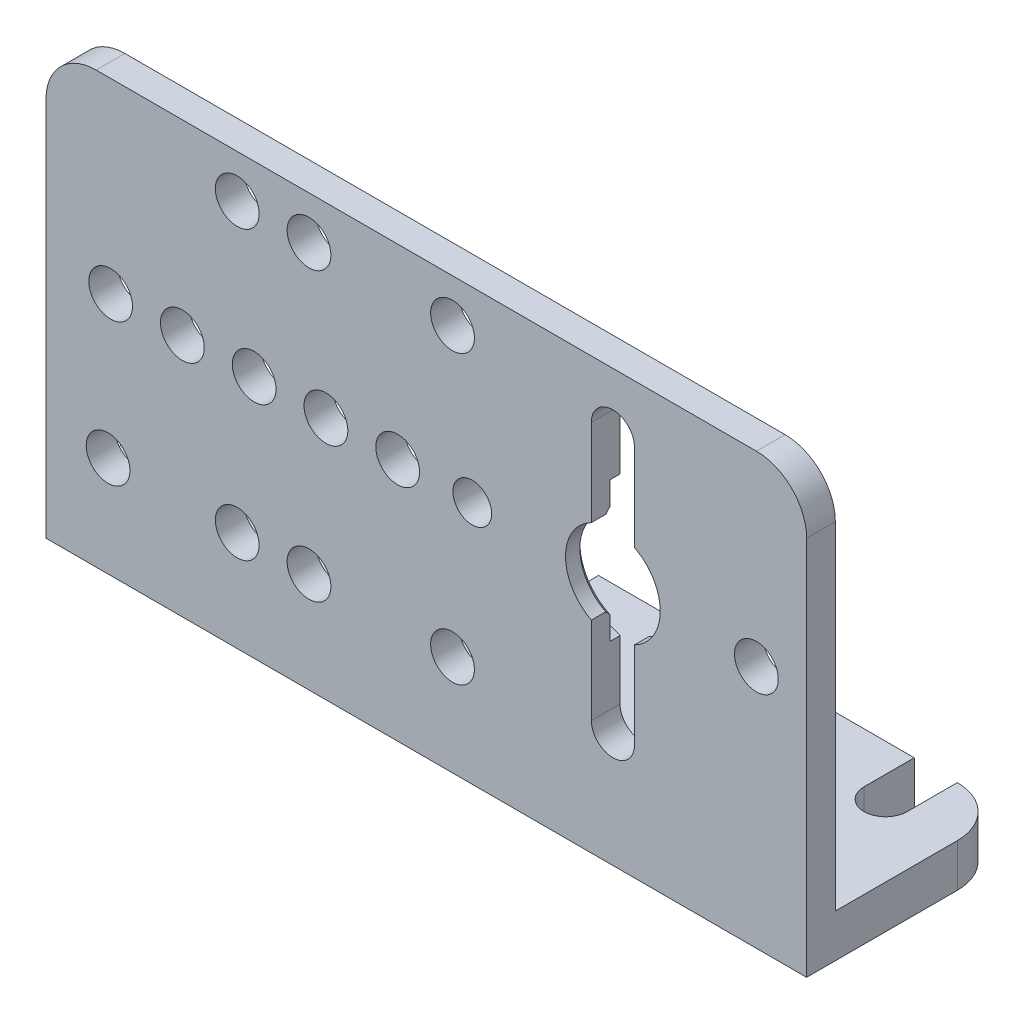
from build123d import *

# Parameters (mm, degrees)
EXTRUSION1_DEPTH        = 26.5
CONG_1_R                = 3.5
ENL_V_MAT_EXTRU_1_DEPTH = 41.339186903
ESQUISSE4_R             = 1.525
ESQUISSE4_R_2           = 1.35
ENL_V_MAT_EXTRU_2_DEPTH = 42.788156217
ESQUISSE5_R             = 5.1
ENL_V_MAT_EXTRU_3_DEPTH = 0.7
CHANFREIN1_SIZE         = 0.3


with BuildPart() as part:
    # Esquisse1 → Extrusion1 (new, symmetric)
    with BuildSketch(Plane(origin=(0, 0, 0), x_dir=(0, 0, -1), z_dir=(1, 0, 0))):
        Polygon((0, 0), (14, 0), (14, 3), (2, 3), (2, 30), (0, 30), align=None)
    extrude(amount=EXTRUSION1_DEPTH, both=True)

    # Cong_1
    cong_1_edges = [part.edges().sort_by_distance(p)[0] for p in [
        (26.5, 1.5, -14),
        (26.5, 30, -1),
        (-26.5, 30, -1),
        (-26.5, 1.5, -14),
    ]]
    fillet(cong_1_edges, radius=CONG_1_R)

    # Esquisse3 → Enl_v. mat.-Extru.1 (cut, through all)
    with BuildSketch(Plane(origin=(0, 3, 0), x_dir=(1, 0, 0), z_dir=(0, 1, 0))):
        with BuildLine():
            Line((-20, 14), (-17, 14))
            Line((-17, 14), (-17, 10.5))
            ThreePointArc((-17, 10.5), (-18.5, 9), (-20, 10.5))
            Line((-20, 10.5), (-20, 14))
        make_face()
        with BuildLine():
            Line((-5, 14), (-2, 14))
            Line((-2, 14), (-2, 10.5))
            ThreePointArc((-2, 10.5), (-3.5, 9), (-5, 10.5))
            Line((-5, 10.5), (-5, 14))
        make_face()
        with BuildLine():
            Line((20, 14), (23, 14))
            Line((23, 14), (23, 10.5))
            ThreePointArc((23, 10.5), (21.5, 9), (20, 10.5))
            Line((20, 10.5), (20, 14))
        make_face()
    extrude(amount=-ENL_V_MAT_EXTRU_1_DEPTH, mode=Mode.SUBTRACT)

    # Esquisse4 → Enl_v. mat.-Extru.2 (cut, through all)
    with BuildSketch(Plane(origin=(0, 0, -2), x_dir=(-1, 0, 0), z_dir=(0, 0, -1))):
        with Locations((1.995723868, 17)):
            Circle(ESQUISSE4_R)
        with Locations((-1.825397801, 7)):
            Circle(ESQUISSE4_R)
        with Locations((8.174602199, 7)):
            Circle(ESQUISSE4_R)
        with Locations(Location((8.174602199, 27, 0), (0, 0, 180))):
            Circle(ESQUISSE4_R)
        with Locations((6.995723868, 17)):
            Circle(ESQUISSE4_R)
        with Locations((11.995723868, 17)):
            Circle(ESQUISSE4_R)
        with Locations((16.995723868, 17)):
            Circle(ESQUISSE4_R)
        with Locations((-23, 17)):
            Circle(ESQUISSE4_R)
        with Locations(Location((-1.825397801, 27, 0), (0, 0, 180))):
            Circle(ESQUISSE4_R)
        with Locations((21.995723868, 17)):
            Circle(ESQUISSE4_R)
        with Locations((13.174602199, 7)):
            Circle(ESQUISSE4_R)
        with Locations(Location((13.174602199, 27, 0), (0, 0, 180))):
            Circle(ESQUISSE4_R)
        with Locations((22.174602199, 7)):
            Circle(ESQUISSE4_R)
        with Locations((-3.2, 17)):
            Circle(ESQUISSE4_R_2)
        with BuildLine():
            Line((-14.5, 14.060612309), (-14.5, 8))
            ThreePointArc((-14.5, 8), (-13, 6.5), (-11.5, 8))
            Line((-11.5, 8), (-11.5, 14.060612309))
            ThreePointArc((-11.5, 14.060612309), (-9.7, 17), (-11.5, 19.939387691))
            Line((-11.5, 19.939387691), (-11.5, 26))
            ThreePointArc((-11.5, 26), (-13, 27.5), (-14.5, 26))
            Line((-14.5, 26), (-14.5, 19.939387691))
            ThreePointArc((-14.5, 19.939387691), (-16.3, 17), (-14.5, 14.060612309))
        make_face()
    extrude(amount=-ENL_V_MAT_EXTRU_2_DEPTH, mode=Mode.SUBTRACT)

    # Esquisse5 → Enl_v. mat.-Extru.3 (cut)
    with BuildSketch(Plane(origin=(0, 0, -2), x_dir=(-1, 0, 0), z_dir=(0, 0, -1))):
        with Locations((-13, 17)):
            Circle(ESQUISSE5_R)
    extrude(amount=-ENL_V_MAT_EXTRU_3_DEPTH, mode=Mode.SUBTRACT)

    # Chanfrein1
    chanfrein1_edges = [part.edges().sort_by_distance(p)[0] for p in [
        (9.7, 17, -1.3),
        (16.3, 17, -1.3),
    ]]
    chamfer(chanfrein1_edges, length=CHANFREIN1_SIZE)


solid = part.part
